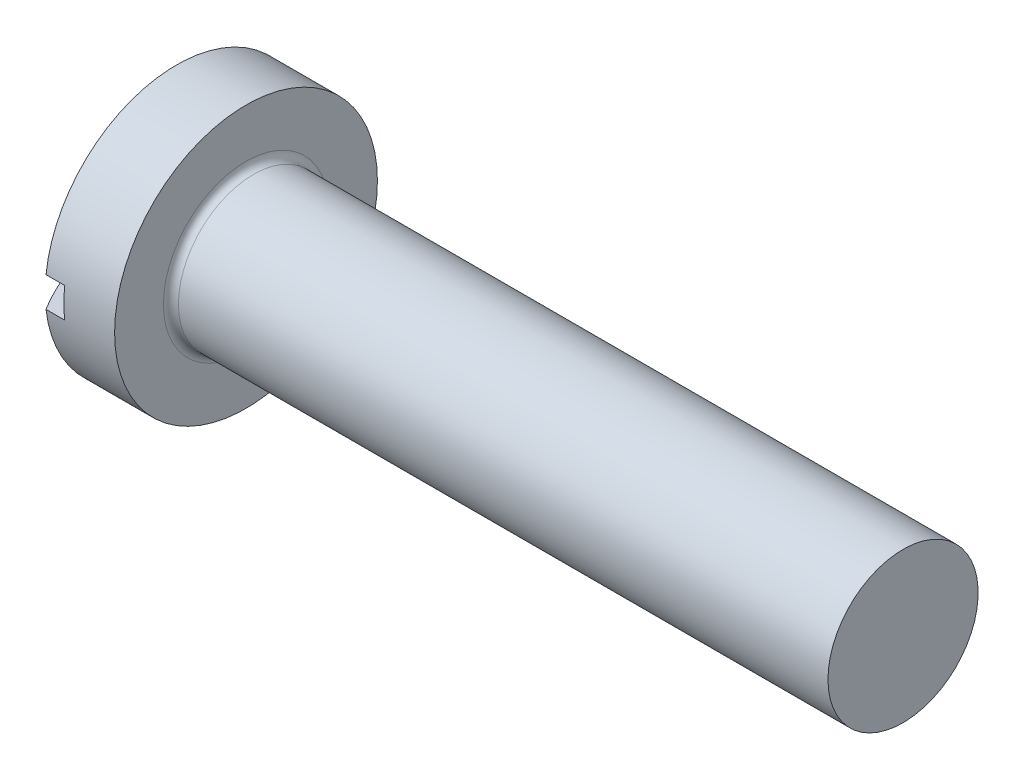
from build123d import *

# Parameters (mm, degrees)
FILLET1_R  = 0.4
SKETCH2_W  = 14
SKETCH2_H  = 1.6
SLOT_DEPTH = 3


with BuildPart() as part:
    # BodySke → Base-Revolve (revolve)
    with BuildSketch(Plane.XY, mode=Mode.PRIVATE) as base_revolve_sk:
        with BuildLine():
            Line((5.7, 4), (5.7, 7))
            Line((5.7, 7), (2, 7))
            ThreePointArc((2, 7), (0.509807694, 3.640054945), (0, 0))
            Line((0, 0), (40.7, 0))
            Line((40.7, 0), (40.7, 4))
            Line((40.7, 4), (5.7, 4))
        make_face()
    revolve(base_revolve_sk.sketch.rotate(Axis((-25.4, 0, 0), (1, 0, 0)), 90), axis=Axis((-25.4, 0, 0), (1, 0, 0)))

    # Fillet1
    fillet1_edges = [part.edges().sort_by_distance(p)[0] for p in [
        (5.7, 0, -4),
    ]]
    fillet(fillet1_edges, radius=FILLET1_R)

    # Sketch2 → Slot (cut)
    with BuildSketch(Plane(origin=(0, 0, 0), x_dir=(0, 0, -1), z_dir=(1, 0, 0))):
        Rectangle(SKETCH2_W, SKETCH2_H)
    extrude(amount=SLOT_DEPTH, mode=Mode.SUBTRACT)


solid = part.part
